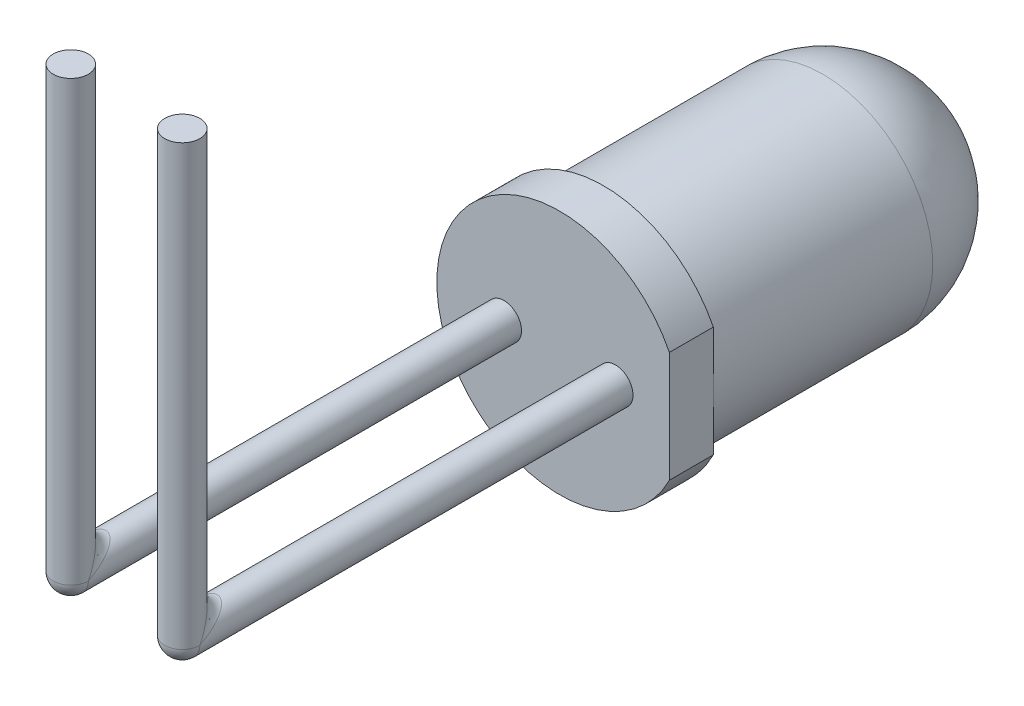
ISO-10303-21;
HEADER;
FILE_DESCRIPTION(('STEP AP214'),'2;1');
FILE_NAME('part.step','',(''),(''),'','','');
FILE_SCHEMA(('AUTOMOTIVE_DESIGN { 1 0 10303 214 1 1 1 1 }'));
ENDSEC;
DATA;
#1=APPLICATION_CONTEXT('core data for automotive mechanical design processes');
#2=APPLICATION_PROTOCOL_DEFINITION('international standard','automotive_design',2000,#1);
#3=PRODUCT_CONTEXT('',#1,'mechanical');
#4=PRODUCT('Part','Part','',(#3));
#5=PRODUCT_RELATED_PRODUCT_CATEGORY('part','',(#4));
#6=PRODUCT_DEFINITION_FORMATION('','',#4);
#7=PRODUCT_DEFINITION_CONTEXT('part definition',#1,'design');
#8=PRODUCT_DEFINITION('design','',#6,#7);
#9=PRODUCT_DEFINITION_SHAPE('','',#8);
#10=(LENGTH_UNIT() NAMED_UNIT(*) SI_UNIT(.MILLI.,.METRE.));
#11=(NAMED_UNIT(*) PLANE_ANGLE_UNIT() SI_UNIT($,.RADIAN.));
#12=(NAMED_UNIT(*) SI_UNIT($,.STERADIAN.) SOLID_ANGLE_UNIT());
#13=UNCERTAINTY_MEASURE_WITH_UNIT(LENGTH_MEASURE(1.E-05),#10,'distance_accuracy_value','');
#14=(GEOMETRIC_REPRESENTATION_CONTEXT(3) GLOBAL_UNCERTAINTY_ASSIGNED_CONTEXT((#13)) GLOBAL_UNIT_ASSIGNED_CONTEXT((#10,
#11,#12)) REPRESENTATION_CONTEXT('',''));
#15=CARTESIAN_POINT('',(0.,0.,0.));
#16=DIRECTION('',(0.,0.,1.));
#17=DIRECTION('',(1.,0.,0.));
#18=AXIS2_PLACEMENT_3D('',#15,#16,#17);
#19=CARTESIAN_POINT('',(0.,0.,8.5));
#20=DIRECTION('',(0.,0.,-1.));
#21=DIRECTION('',(-1.,0.,0.));
#22=AXIS2_PLACEMENT_3D('',#19,#20,#21);
#23=CYLINDRICAL_SURFACE('',#22,2.5);
#24=CARTESIAN_POINT('',(0.,0.,2.5));
#25=DIRECTION('',(0.,0.,-1.));
#26=DIRECTION('',(-1.,0.,0.));
#27=AXIS2_PLACEMENT_3D('',#24,#25,#26);
#28=CIRCLE('',#27,2.5);
#29=CARTESIAN_POINT('',(-2.5,0.,2.5));
#30=VERTEX_POINT('',#29);
#31=EDGE_CURVE('E99',#30,#30,#28,.F.);
#32=ORIENTED_EDGE('',*,*,#31,.T.);
#33=EDGE_LOOP('',(#32));
#34=FACE_BOUND('',#33,.T.);
#35=CARTESIAN_POINT('',(0.,0.,7.5));
#36=DIRECTION('',(0.,0.,1.));
#37=DIRECTION('',(1.,0.,0.));
#38=AXIS2_PLACEMENT_3D('',#35,#36,#37);
#39=CIRCLE('',#38,2.5);
#40=CARTESIAN_POINT('',(2.5,0.,7.5));
#41=VERTEX_POINT('',#40);
#42=EDGE_CURVE('E95',#41,#41,#39,.T.);
#43=ORIENTED_EDGE('',*,*,#42,.F.);
#44=EDGE_LOOP('',(#43));
#45=FACE_BOUND('',#44,.T.);
#46=ADVANCED_FACE('F28',(#34,#45),#23,.T.);
#47=CARTESIAN_POINT('',(0.,0.,7.5));
#48=DIRECTION('',(0.,0.,1.));
#49=DIRECTION('',(1.,0.,0.));
#50=AXIS2_PLACEMENT_3D('',#47,#48,#49);
#51=PLANE('',#50);
#52=DIRECTION('',(0.,1.,0.));
#53=VECTOR('',#52,1.);
#54=CARTESIAN_POINT('',(2.5,1.26095202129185,7.5));
#55=LINE('',#54,#53);
#56=CARTESIAN_POINT('',(2.5,1.26095202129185,7.5));
#57=VERTEX_POINT('',#56);
#58=EDGE_CURVE('E90',#41,#57,#55,.T.);
#59=ORIENTED_EDGE('',*,*,#58,.F.);
#60=ORIENTED_EDGE('',*,*,#42,.T.);
#61=CARTESIAN_POINT('',(2.5,-1.26095202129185,7.5));
#62=VERTEX_POINT('',#61);
#63=EDGE_CURVE('E80',#62,#41,#55,.T.);
#64=ORIENTED_EDGE('',*,*,#63,.F.);
#65=CARTESIAN_POINT('',(0.,0.,7.5));
#66=DIRECTION('',(0.,0.,1.));
#67=DIRECTION('',(1.,0.,0.));
#68=AXIS2_PLACEMENT_3D('',#65,#66,#67);
#69=CIRCLE('',#68,2.8);
#70=EDGE_CURVE('E74',#57,#62,#69,.T.);
#71=ORIENTED_EDGE('',*,*,#70,.F.);
#72=EDGE_LOOP('',(#59,#60,#64,#71));
#73=FACE_BOUND('',#72,.T.);
#74=ADVANCED_FACE('F140',(#73),#51,.F.);
#75=CARTESIAN_POINT('',(2.5,1.26095202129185,7.5));
#76=DIRECTION('',(1.,0.,0.));
#77=DIRECTION('',(0.,0.,-1.));
#78=AXIS2_PLACEMENT_3D('',#75,#76,#77);
#79=PLANE('',#78);
#80=ORIENTED_EDGE('',*,*,#63,.T.);
#81=ORIENTED_EDGE('',*,*,#58,.T.);
#82=DIRECTION('',(0.,0.,1.));
#83=VECTOR('',#82,1.);
#84=CARTESIAN_POINT('',(2.5,1.26095202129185,7.5));
#85=LINE('',#84,#83);
#86=CARTESIAN_POINT('',(2.5,1.26095202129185,8.5));
#87=VERTEX_POINT('',#86);
#88=EDGE_CURVE('E79',#57,#87,#85,.T.);
#89=ORIENTED_EDGE('',*,*,#88,.T.);
#90=DIRECTION('',(0.,1.,0.));
#91=VECTOR('',#90,1.);
#92=CARTESIAN_POINT('',(2.5,1.26095202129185,8.5));
#93=LINE('',#92,#91);
#94=CARTESIAN_POINT('',(2.5,-1.26095202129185,8.5));
#95=VERTEX_POINT('',#94);
#96=EDGE_CURVE('E84',#95,#87,#93,.T.);
#97=ORIENTED_EDGE('',*,*,#96,.F.);
#98=DIRECTION('',(0.,0.,1.));
#99=VECTOR('',#98,1.);
#100=CARTESIAN_POINT('',(2.5,-1.26095202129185,7.5));
#101=LINE('',#100,#99);
#102=EDGE_CURVE('E68',#62,#95,#101,.T.);
#103=ORIENTED_EDGE('',*,*,#102,.F.);
#104=EDGE_LOOP('',(#80,#81,#89,#97,#103));
#105=FACE_BOUND('',#104,.T.);
#106=ADVANCED_FACE('F88',(#105),#79,.T.);
#107=CARTESIAN_POINT('',(0.,0.,7.5));
#108=DIRECTION('',(0.,0.,1.));
#109=DIRECTION('',(1.,0.,0.));
#110=AXIS2_PLACEMENT_3D('',#107,#108,#109);
#111=CYLINDRICAL_SURFACE('',#110,2.8);
#112=CARTESIAN_POINT('',(0.,0.,8.5));
#113=DIRECTION('',(0.,0.,1.));
#114=DIRECTION('',(1.,0.,0.));
#115=AXIS2_PLACEMENT_3D('',#112,#113,#114);
#116=CIRCLE('',#115,2.8);
#117=EDGE_CURVE('E72',#87,#95,#116,.T.);
#118=ORIENTED_EDGE('',*,*,#117,.F.);
#119=ORIENTED_EDGE('',*,*,#88,.F.);
#120=ORIENTED_EDGE('',*,*,#70,.T.);
#121=ORIENTED_EDGE('',*,*,#102,.T.);
#122=EDGE_LOOP('',(#118,#119,#120,#121));
#123=FACE_BOUND('',#122,.T.);
#124=ADVANCED_FACE('F70',(#123),#111,.T.);
#125=CARTESIAN_POINT('',(0.,0.,8.5));
#126=DIRECTION('',(0.,0.,1.));
#127=DIRECTION('',(1.,0.,0.));
#128=AXIS2_PLACEMENT_3D('',#125,#126,#127);
#129=PLANE('',#128);
#130=CARTESIAN_POINT('',(-1.27,0.,8.5));
#131=DIRECTION('',(0.,0.,1.));
#132=DIRECTION('',(1.,0.,0.));
#133=AXIS2_PLACEMENT_3D('',#130,#131,#132);
#134=CIRCLE('',#133,0.4);
#135=CARTESIAN_POINT('',(-0.87,0.,8.5));
#136=VERTEX_POINT('',#135);
#137=EDGE_CURVE('E107',#136,#136,#134,.T.);
#138=ORIENTED_EDGE('',*,*,#137,.F.);
#139=EDGE_LOOP('',(#138));
#140=FACE_BOUND('',#139,.T.);
#141=CARTESIAN_POINT('',(1.27,0.,8.5));
#142=DIRECTION('',(0.,0.,1.));
#143=DIRECTION('',(1.,0.,0.));
#144=AXIS2_PLACEMENT_3D('',#141,#142,#143);
#145=CIRCLE('',#144,0.4);
#146=CARTESIAN_POINT('',(1.67,0.,8.5));
#147=VERTEX_POINT('',#146);
#148=EDGE_CURVE('E102',#147,#147,#145,.T.);
#149=ORIENTED_EDGE('',*,*,#148,.F.);
#150=EDGE_LOOP('',(#149));
#151=FACE_BOUND('',#150,.T.);
#152=ORIENTED_EDGE('',*,*,#96,.T.);
#153=ORIENTED_EDGE('',*,*,#117,.T.);
#154=EDGE_LOOP('',(#152,#153));
#155=FACE_BOUND('',#154,.T.);
#156=ADVANCED_FACE('F83',(#140,#151,#155),#129,.T.);
#157=CARTESIAN_POINT('',(0.,0.,2.5));
#158=DIRECTION('',(0.,0.,1.));
#159=DIRECTION('',(1.,0.,0.));
#160=AXIS2_PLACEMENT_3D('',#157,#158,#159);
#161=SPHERICAL_SURFACE('',#160,2.5);
#162=ORIENTED_EDGE('',*,*,#31,.F.);
#163=EDGE_LOOP('',(#162));
#164=FACE_BOUND('',#163,.T.);
#165=ADVANCED_FACE('F153',(#164),#161,.T.);
#166=CARTESIAN_POINT('',(1.27,0.,18.37));
#167=DIRECTION('',(0.,1.,0.));
#168=DIRECTION('',(0.,0.,1.));
#169=AXIS2_PLACEMENT_3D('',#166,#167,#168);
#170=CYLINDRICAL_SURFACE('',#169,0.4);
#171=CARTESIAN_POINT('',(1.27,0.,18.37));
#172=DIRECTION('',(0.,-0.447213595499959,-0.894427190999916));
#173=DIRECTION('',(0.,0.894427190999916,-0.447213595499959));
#174=AXIS2_PLACEMENT_3D('',#171,#172,#173);
#175=ELLIPSE('',#174,0.894427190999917,0.4);
#176=CARTESIAN_POINT('',(1.67,0.,18.37));
#177=VERTEX_POINT('',#176);
#178=CARTESIAN_POINT('',(0.87,0.,18.37));
#179=VERTEX_POINT('',#178);
#180=EDGE_CURVE('E103',#177,#179,#175,.F.);
#181=ORIENTED_EDGE('',*,*,#180,.T.);
#182=CARTESIAN_POINT('',(1.27,0.,18.37));
#183=DIRECTION('',(0.,1.,0.));
#184=DIRECTION('',(0.,0.,1.));
#185=AXIS2_PLACEMENT_3D('',#182,#183,#184);
#186=CIRCLE('',#185,0.4);
#187=EDGE_CURVE('E106',#179,#177,#186,.T.);
#188=ORIENTED_EDGE('',*,*,#187,.T.);
#189=EDGE_LOOP('',(#181,#188));
#190=FACE_BOUND('',#189,.T.);
#191=CARTESIAN_POINT('',(1.27,10.,18.37));
#192=DIRECTION('',(0.,1.,0.));
#193=DIRECTION('',(0.,0.,1.));
#194=AXIS2_PLACEMENT_3D('',#191,#192,#193);
#195=CIRCLE('',#194,0.4);
#196=CARTESIAN_POINT('',(1.27,10.,18.77));
#197=VERTEX_POINT('',#196);
#198=EDGE_CURVE('E86',#197,#197,#195,.F.);
#199=ORIENTED_EDGE('',*,*,#198,.T.);
#200=EDGE_LOOP('',(#199));
#201=FACE_BOUND('',#200,.T.);
#202=ADVANCED_FACE('F154',(#190,#201),#170,.T.);
#203=CARTESIAN_POINT('',(1.27,0.,19.5013708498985));
#204=DIRECTION('',(0.,0.,-1.));
#205=DIRECTION('',(0.,1.,0.));
#206=AXIS2_PLACEMENT_3D('',#203,#204,#205);
#207=CYLINDRICAL_SURFACE('',#206,0.4);
#208=ORIENTED_EDGE('',*,*,#148,.T.);
#209=EDGE_LOOP('',(#208));
#210=FACE_BOUND('',#209,.T.);
#211=CARTESIAN_POINT('',(1.27,0.,18.37));
#212=DIRECTION('',(0.,0.,-1.));
#213=DIRECTION('',(0.,1.,0.));
#214=AXIS2_PLACEMENT_3D('',#211,#212,#213);
#215=CIRCLE('',#214,0.4);
#216=EDGE_CURVE('E110',#177,#179,#215,.T.);
#217=ORIENTED_EDGE('',*,*,#216,.T.);
#218=CARTESIAN_POINT('',(1.27,0.,18.37));
#219=DIRECTION('',(0.,-0.894427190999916,-0.447213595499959));
#220=DIRECTION('',(0.,0.447213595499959,-0.894427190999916));
#221=AXIS2_PLACEMENT_3D('',#218,#219,#220);
#222=ELLIPSE('',#221,0.894427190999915,0.4);
#223=EDGE_CURVE('E113',#179,#177,#222,.T.);
#224=ORIENTED_EDGE('',*,*,#223,.T.);
#225=EDGE_LOOP('',(#217,#224));
#226=FACE_BOUND('',#225,.T.);
#227=ADVANCED_FACE('F160',(#210,#226),#207,.T.);
#228=CARTESIAN_POINT('',(1.27,10.,18.37));
#229=DIRECTION('',(0.,1.,0.));
#230=DIRECTION('',(0.,0.,1.));
#231=AXIS2_PLACEMENT_3D('',#228,#229,#230);
#232=PLANE('',#231);
#233=ORIENTED_EDGE('',*,*,#198,.F.);
#234=EDGE_LOOP('',(#233));
#235=FACE_BOUND('',#234,.T.);
#236=ADVANCED_FACE('F203',(#235),#232,.T.);
#237=CARTESIAN_POINT('',(-1.27,0.,18.37));
#238=DIRECTION('',(0.,1.,0.));
#239=DIRECTION('',(0.,0.,1.));
#240=AXIS2_PLACEMENT_3D('',#237,#238,#239);
#241=CYLINDRICAL_SURFACE('',#240,0.4);
#242=CARTESIAN_POINT('',(-1.27,0.,18.37));
#243=DIRECTION('',(0.,-0.447213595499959,-0.894427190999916));
#244=DIRECTION('',(0.,0.894427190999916,-0.447213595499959));
#245=AXIS2_PLACEMENT_3D('',#242,#243,#244);
#246=ELLIPSE('',#245,0.894427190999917,0.4);
#247=CARTESIAN_POINT('',(-0.87,0.,18.37));
#248=VERTEX_POINT('',#247);
#249=CARTESIAN_POINT('',(-1.67,0.,18.37));
#250=VERTEX_POINT('',#249);
#251=EDGE_CURVE('E116',#248,#250,#246,.F.);
#252=ORIENTED_EDGE('',*,*,#251,.T.);
#253=CARTESIAN_POINT('',(-1.27,0.,18.37));
#254=DIRECTION('',(0.,1.,0.));
#255=DIRECTION('',(0.,0.,1.));
#256=AXIS2_PLACEMENT_3D('',#253,#254,#255);
#257=CIRCLE('',#256,0.4);
#258=EDGE_CURVE('E119',#250,#248,#257,.T.);
#259=ORIENTED_EDGE('',*,*,#258,.T.);
#260=EDGE_LOOP('',(#252,#259));
#261=FACE_BOUND('',#260,.T.);
#262=CARTESIAN_POINT('',(-1.27,10.,18.37));
#263=DIRECTION('',(0.,1.,0.));
#264=DIRECTION('',(0.,0.,1.));
#265=AXIS2_PLACEMENT_3D('',#262,#263,#264);
#266=CIRCLE('',#265,0.4);
#267=CARTESIAN_POINT('',(-1.27,10.,18.77));
#268=VERTEX_POINT('',#267);
#269=EDGE_CURVE('E262',#268,#268,#266,.F.);
#270=ORIENTED_EDGE('',*,*,#269,.T.);
#271=EDGE_LOOP('',(#270));
#272=FACE_BOUND('',#271,.T.);
#273=ADVANCED_FACE('F124',(#261,#272),#241,.T.);
#274=CARTESIAN_POINT('',(-1.27,0.,19.5013708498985));
#275=DIRECTION('',(0.,0.,-1.));
#276=DIRECTION('',(0.,1.,0.));
#277=AXIS2_PLACEMENT_3D('',#274,#275,#276);
#278=CYLINDRICAL_SURFACE('',#277,0.4);
#279=ORIENTED_EDGE('',*,*,#137,.T.);
#280=EDGE_LOOP('',(#279));
#281=FACE_BOUND('',#280,.T.);
#282=CARTESIAN_POINT('',(-1.27,0.,18.37));
#283=DIRECTION('',(0.,0.,-1.));
#284=DIRECTION('',(0.,1.,0.));
#285=AXIS2_PLACEMENT_3D('',#282,#283,#284);
#286=CIRCLE('',#285,0.4);
#287=EDGE_CURVE('E35',#248,#250,#286,.T.);
#288=ORIENTED_EDGE('',*,*,#287,.T.);
#289=CARTESIAN_POINT('',(-1.27,0.,18.37));
#290=DIRECTION('',(0.,-0.894427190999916,-0.447213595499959));
#291=DIRECTION('',(0.,0.447213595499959,-0.894427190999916));
#292=AXIS2_PLACEMENT_3D('',#289,#290,#291);
#293=ELLIPSE('',#292,0.894427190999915,0.4);
#294=EDGE_CURVE('E12',#250,#248,#293,.T.);
#295=ORIENTED_EDGE('',*,*,#294,.T.);
#296=EDGE_LOOP('',(#288,#295));
#297=FACE_BOUND('',#296,.T.);
#298=ADVANCED_FACE('F122',(#281,#297),#278,.T.);
#299=CARTESIAN_POINT('',(-1.27,10.,18.37));
#300=DIRECTION('',(0.,1.,0.));
#301=DIRECTION('',(0.,0.,1.));
#302=AXIS2_PLACEMENT_3D('',#299,#300,#301);
#303=PLANE('',#302);
#304=ORIENTED_EDGE('',*,*,#269,.F.);
#305=EDGE_LOOP('',(#304));
#306=FACE_BOUND('',#305,.T.);
#307=ADVANCED_FACE('F222',(#306),#303,.T.);
#308=CARTESIAN_POINT('',(1.27,0.,18.37));
#309=DIRECTION('',(0.,0.,1.));
#310=DIRECTION('',(1.,0.,0.));
#311=AXIS2_PLACEMENT_3D('',#308,#309,#310);
#312=SPHERICAL_SURFACE('',#311,0.4);
#313=ORIENTED_EDGE('',*,*,#187,.F.);
#314=ORIENTED_EDGE('',*,*,#216,.F.);
#315=EDGE_LOOP('',(#313,#314));
#316=FACE_BOUND('',#315,.T.);
#317=ADVANCED_FACE('F136',(#316),#312,.T.);
#318=CARTESIAN_POINT('',(1.67,0.,18.37));
#319=CARTESIAN_POINT('',(1.67,0.,18.37));
#320=CARTESIAN_POINT('',(1.67,0.,18.37));
#321=CARTESIAN_POINT('',(1.66999298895,0.0348517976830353,18.3525741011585));
#322=CARTESIAN_POINT('',(1.67005108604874,0.0261441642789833,18.343855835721));
#323=CARTESIAN_POINT('',(1.66999298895,0.0174258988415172,18.335148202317));
#324=CARTESIAN_POINT('',(1.66886070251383,0.0697124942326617,18.3351437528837));
#325=CARTESIAN_POINT('',(1.66772093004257,0.0523600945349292,18.3176399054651));
#326=CARTESIAN_POINT('',(1.66886070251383,0.0348562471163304,18.3002875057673));
#327=CARTESIAN_POINT('',(1.66431458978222,0.138834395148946,18.3005828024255));
#328=CARTESIAN_POINT('',(1.65863330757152,0.103749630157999,18.266250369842));
#329=CARTESIAN_POINT('',(1.66431458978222,0.0694171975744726,18.231165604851));
#330=CARTESIAN_POINT('',(1.66092023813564,0.173098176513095,18.2834509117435));
#331=CARTESIAN_POINT('',(1.65186272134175,0.129071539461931,18.2409284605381));
#332=CARTESIAN_POINT('',(1.66092023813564,0.0865490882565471,18.1969018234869));
#333=CARTESIAN_POINT('',(1.65189673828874,0.24044273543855,18.2497786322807));
#334=CARTESIAN_POINT('',(1.63414910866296,0.177786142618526,18.1922138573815));
#335=CARTESIAN_POINT('',(1.65189673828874,0.120221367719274,18.1295572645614));
#336=CARTESIAN_POINT('',(1.6463060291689,0.273533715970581,18.2332331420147));
#337=CARTESIAN_POINT('',(1.62318021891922,0.201325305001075,18.1686746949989));
#338=CARTESIAN_POINT('',(1.6463060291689,0.13676685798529,18.0964662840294));
#339=CARTESIAN_POINT('',(1.63296398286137,0.337956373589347,18.2010218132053));
#340=CARTESIAN_POINT('',(1.59763412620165,0.245616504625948,18.124383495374));
#341=CARTESIAN_POINT('',(1.63296398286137,0.168978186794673,18.0320436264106));
#342=CARTESIAN_POINT('',(1.62526926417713,0.369311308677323,18.1853443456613));
#343=CARTESIAN_POINT('',(1.58301825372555,0.266510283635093,18.1034897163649));
#344=CARTESIAN_POINT('',(1.62526926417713,0.184655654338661,18.0006886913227));
#345=CARTESIAN_POINT('',(1.60783304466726,0.429711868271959,18.155144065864));
#346=CARTESIAN_POINT('',(1.55100028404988,0.304712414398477,18.0652875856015));
#347=CARTESIAN_POINT('',(1.60783304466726,0.214855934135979,17.940288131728));
#348=CARTESIAN_POINT('',(1.59816448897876,0.458799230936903,18.1406003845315));
#349=CARTESIAN_POINT('',(1.53354818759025,0.32215419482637,18.0478458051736));
#350=CARTESIAN_POINT('',(1.59816448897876,0.229399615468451,17.9112007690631));
#351=CARTESIAN_POINT('',(1.57692939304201,0.514147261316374,18.1129263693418));
#352=CARTESIAN_POINT('',(1.49701863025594,0.352779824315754,18.0172201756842));
#353=CARTESIAN_POINT('',(1.57692939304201,0.257073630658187,17.8558527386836));
#354=CARTESIAN_POINT('',(1.56544892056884,0.540473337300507,18.0997633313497));
#355=CARTESIAN_POINT('',(1.47788315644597,0.366083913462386,18.0039160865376));
#356=CARTESIAN_POINT('',(1.56544892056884,0.270236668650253,17.8295266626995));
#357=CARTESIAN_POINT('',(1.54077355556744,0.589823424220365,18.0750882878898));
#358=CARTESIAN_POINT('',(1.43951787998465,0.388004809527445,17.9819951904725));
#359=CARTESIAN_POINT('',(1.54077355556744,0.294911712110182,17.7801765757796));
#360=CARTESIAN_POINT('',(1.52767253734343,0.612940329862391,18.0635298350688));
#361=CARTESIAN_POINT('',(1.42022816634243,0.396723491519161,17.9732765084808));
#362=CARTESIAN_POINT('',(1.52767253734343,0.306470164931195,17.7570596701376));
#363=CARTESIAN_POINT('',(1.49997342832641,0.655447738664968,18.0422761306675));
#364=CARTESIAN_POINT('',(1.38341468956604,0.409472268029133,17.9605277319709));
#365=CARTESIAN_POINT('',(1.49997342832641,0.327723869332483,17.714552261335));
#366=CARTESIAN_POINT('',(1.48546909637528,0.674959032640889,18.0325204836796));
#367=CARTESIAN_POINT('',(1.36583761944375,0.413582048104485,17.9564179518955));
#368=CARTESIAN_POINT('',(1.48546909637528,0.337479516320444,17.6950409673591));
#369=CARTESIAN_POINT('',(1.45521408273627,0.709892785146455,18.0150536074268));
#370=CARTESIAN_POINT('',(1.33439698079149,0.417771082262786,17.9522289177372));
#371=CARTESIAN_POINT('',(1.45521408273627,0.354946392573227,17.6601072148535));
#372=CARTESIAN_POINT('',(1.43954673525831,0.725457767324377,18.0072711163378));
#373=CARTESIAN_POINT('',(1.32049509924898,0.417907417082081,17.9520925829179));
#374=CARTESIAN_POINT('',(1.43954673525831,0.362728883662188,17.6445422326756));
#375=CARTESIAN_POINT('',(1.40724861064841,0.752212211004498,17.9938938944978));
#376=CARTESIAN_POINT('',(1.2978686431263,0.41562409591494,17.9543759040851));
#377=CARTESIAN_POINT('',(1.40724861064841,0.376106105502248,17.6177877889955));
#378=CARTESIAN_POINT('',(1.39068005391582,0.763549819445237,17.9882250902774));
#379=CARTESIAN_POINT('',(1.28912434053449,0.413242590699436,17.9567574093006));
#380=CARTESIAN_POINT('',(1.39068005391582,0.381774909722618,17.6064501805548));
#381=CARTESIAN_POINT('',(1.35689020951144,0.781655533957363,17.9791722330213));
#382=CARTESIAN_POINT('',(1.2769352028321,0.40803809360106,17.9619619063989));
#383=CARTESIAN_POINT('',(1.35689020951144,0.390827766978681,17.5883444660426));
#384=CARTESIAN_POINT('',(1.33970345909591,0.788550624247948,17.975724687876));
#385=CARTESIAN_POINT('',(1.27348474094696,0.405239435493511,17.9647605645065));
#386=CARTESIAN_POINT('',(1.33970345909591,0.394275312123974,17.581449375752));
#387=CARTESIAN_POINT('',(1.30500449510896,0.797685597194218,17.9711572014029));
#388=CARTESIAN_POINT('',(1.27002308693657,0.401214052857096,17.9687859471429));
#389=CARTESIAN_POINT('',(1.30500449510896,0.398842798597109,17.5723144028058));
#390=CARTESIAN_POINT('',(1.28750224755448,0.799999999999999,17.97));
#391=CARTESIAN_POINT('',(1.27001157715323,0.399999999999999,17.97));
#392=CARTESIAN_POINT('',(1.28750224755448,0.399999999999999,17.57));
#393=CARTESIAN_POINT('',(1.25249775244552,0.799999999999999,17.97));
#394=CARTESIAN_POINT('',(1.26998842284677,0.399999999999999,17.97));
#395=CARTESIAN_POINT('',(1.25249775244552,0.399999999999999,17.57));
#396=CARTESIAN_POINT('',(1.23499550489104,0.797685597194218,17.9711572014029));
#397=CARTESIAN_POINT('',(1.26997691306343,0.401214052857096,17.9687859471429));
#398=CARTESIAN_POINT('',(1.23499550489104,0.398842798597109,17.5723144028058));
#399=CARTESIAN_POINT('',(1.20029654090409,0.788550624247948,17.975724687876));
#400=CARTESIAN_POINT('',(1.26651525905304,0.405239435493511,17.9647605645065));
#401=CARTESIAN_POINT('',(1.20029654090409,0.394275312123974,17.581449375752));
#402=CARTESIAN_POINT('',(1.18310979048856,0.781655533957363,17.9791722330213));
#403=CARTESIAN_POINT('',(1.2630647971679,0.40803809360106,17.9619619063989));
#404=CARTESIAN_POINT('',(1.18310979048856,0.390827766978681,17.5883444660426));
#405=CARTESIAN_POINT('',(1.14931994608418,0.763549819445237,17.9882250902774));
#406=CARTESIAN_POINT('',(1.25087565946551,0.413242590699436,17.9567574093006));
#407=CARTESIAN_POINT('',(1.14931994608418,0.381774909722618,17.6064501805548));
#408=CARTESIAN_POINT('',(1.13275138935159,0.752212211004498,17.9938938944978));
#409=CARTESIAN_POINT('',(1.2421313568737,0.41562409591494,17.9543759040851));
#410=CARTESIAN_POINT('',(1.13275138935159,0.376106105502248,17.6177877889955));
#411=CARTESIAN_POINT('',(1.10045326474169,0.725457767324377,18.0072711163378));
#412=CARTESIAN_POINT('',(1.21950490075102,0.417907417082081,17.9520925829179));
#413=CARTESIAN_POINT('',(1.10045326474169,0.362728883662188,17.6445422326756));
#414=CARTESIAN_POINT('',(1.08478591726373,0.709892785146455,18.0150536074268));
#415=CARTESIAN_POINT('',(1.20560301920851,0.417771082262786,17.9522289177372));
#416=CARTESIAN_POINT('',(1.08478591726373,0.354946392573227,17.6601072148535));
#417=CARTESIAN_POINT('',(1.05453090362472,0.674959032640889,18.0325204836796));
#418=CARTESIAN_POINT('',(1.17416238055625,0.413582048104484,17.9564179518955));
#419=CARTESIAN_POINT('',(1.05453090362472,0.337479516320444,17.6950409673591));
#420=CARTESIAN_POINT('',(1.04002657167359,0.655447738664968,18.0422761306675));
#421=CARTESIAN_POINT('',(1.15658531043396,0.409472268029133,17.9605277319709));
#422=CARTESIAN_POINT('',(1.04002657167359,0.327723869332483,17.714552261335));
#423=CARTESIAN_POINT('',(1.01232746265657,0.612940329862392,18.0635298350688));
#424=CARTESIAN_POINT('',(1.11977183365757,0.396723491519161,17.9732765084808));
#425=CARTESIAN_POINT('',(1.01232746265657,0.306470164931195,17.7570596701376));
#426=CARTESIAN_POINT('',(0.999226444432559,0.589823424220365,18.0750882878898));
#427=CARTESIAN_POINT('',(1.10048212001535,0.388004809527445,17.9819951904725));
#428=CARTESIAN_POINT('',(0.999226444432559,0.294911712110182,17.7801765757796));
#429=CARTESIAN_POINT('',(0.974551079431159,0.540473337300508,18.0997633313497));
#430=CARTESIAN_POINT('',(1.06211684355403,0.366083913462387,18.0039160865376));
#431=CARTESIAN_POINT('',(0.974551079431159,0.270236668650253,17.8295266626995));
#432=CARTESIAN_POINT('',(0.96307060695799,0.514147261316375,18.1129263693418));
#433=CARTESIAN_POINT('',(1.04298136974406,0.352779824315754,18.0172201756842));
#434=CARTESIAN_POINT('',(0.963070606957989,0.257073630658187,17.8558527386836));
#435=CARTESIAN_POINT('',(0.941835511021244,0.458799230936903,18.1406003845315));
#436=CARTESIAN_POINT('',(1.00645181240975,0.32215419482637,18.0478458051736));
#437=CARTESIAN_POINT('',(0.941835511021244,0.229399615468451,17.9112007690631));
#438=CARTESIAN_POINT('',(0.932166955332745,0.429711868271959,18.155144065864));
#439=CARTESIAN_POINT('',(0.988999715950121,0.304712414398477,18.0652875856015));
#440=CARTESIAN_POINT('',(0.932166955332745,0.214855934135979,17.940288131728));
#441=CARTESIAN_POINT('',(0.91473073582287,0.369311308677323,18.1853443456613));
#442=CARTESIAN_POINT('',(0.956981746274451,0.266510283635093,18.1034897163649));
#443=CARTESIAN_POINT('',(0.91473073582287,0.184655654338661,18.0006886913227));
#444=CARTESIAN_POINT('',(0.907036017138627,0.337956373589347,18.2010218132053));
#445=CARTESIAN_POINT('',(0.942365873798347,0.245616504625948,18.124383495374));
#446=CARTESIAN_POINT('',(0.907036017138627,0.168978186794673,18.0320436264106));
#447=CARTESIAN_POINT('',(0.893693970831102,0.273533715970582,18.2332331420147));
#448=CARTESIAN_POINT('',(0.916819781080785,0.201325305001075,18.1686746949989));
#449=CARTESIAN_POINT('',(0.893693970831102,0.13676685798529,18.0964662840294));
#450=CARTESIAN_POINT('',(0.888103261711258,0.24044273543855,18.2497786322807));
#451=CARTESIAN_POINT('',(0.905850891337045,0.177786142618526,18.1922138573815));
#452=CARTESIAN_POINT('',(0.888103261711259,0.120221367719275,18.1295572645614));
#453=CARTESIAN_POINT('',(0.879079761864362,0.173098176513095,18.2834509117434));
#454=CARTESIAN_POINT('',(0.888137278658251,0.129071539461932,18.2409284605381));
#455=CARTESIAN_POINT('',(0.879079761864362,0.0865490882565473,18.1969018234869));
#456=CARTESIAN_POINT('',(0.87568541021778,0.138834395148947,18.3005828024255));
#457=CARTESIAN_POINT('',(0.881366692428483,0.103749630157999,18.266250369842));
#458=CARTESIAN_POINT('',(0.87568541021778,0.0694171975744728,18.231165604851));
#459=CARTESIAN_POINT('',(0.871139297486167,0.069712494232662,18.3351437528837));
#460=CARTESIAN_POINT('',(0.872279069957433,0.0523600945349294,18.3176399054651));
#461=CARTESIAN_POINT('',(0.871139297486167,0.0348562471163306,18.3002875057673));
#462=CARTESIAN_POINT('',(0.870007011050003,0.0348517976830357,18.3525741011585));
#463=CARTESIAN_POINT('',(0.869948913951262,0.0261441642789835,18.343855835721));
#464=CARTESIAN_POINT('',(0.870007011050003,0.0174258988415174,18.335148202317));
#465=CARTESIAN_POINT('',(0.87,0.,18.37));
#466=CARTESIAN_POINT('',(0.87,0.,18.37));
#467=CARTESIAN_POINT('',(0.87,0.,18.37));
#468=(BOUNDED_SURFACE() B_SPLINE_SURFACE(3,2,((#318,#319,#320),(#321,#322,#323),(#324,#325,
#326),(#327,#328,#329),(#330,#331,#332),(#333,#334,#335),(#336,#337,#338),(#339,#340,#341),
(#342,#343,#344),(#345,#346,#347),(#348,#349,#350),(#351,#352,#353),(#354,#355,#356),(#357,#358,
#359),(#360,#361,#362),(#363,#364,#365),(#366,#367,#368),(#369,#370,#371),(#372,#373,#374),
(#375,#376,#377),(#378,#379,#380),(#381,#382,#383),(#384,#385,#386),(#387,#388,#389),(#390,#391,
#392),(#393,#394,#395),(#396,#397,#398),(#399,#400,#401),(#402,#403,#404),(#405,#406,#407),
(#408,#409,#410),(#411,#412,#413),(#414,#415,#416),(#417,#418,#419),(#420,#421,#422),(#423,#424,
#425),(#426,#427,#428),(#429,#430,#431),(#432,#433,#434),(#435,#436,#437),(#438,#439,#440),
(#441,#442,#443),(#444,#445,#446),(#447,#448,#449),(#450,#451,#452),(#453,#454,#455),(#456,#457,
#458),(#459,#460,#461),(#462,#463,#464),(#465,#466,#467)),.UNSPECIFIED.,.F.,.F.,
.F.) B_SPLINE_SURFACE_WITH_KNOTS((4,2,2,2,2,2,2,2,2,2,2,2,2,2,2,2,2,2,2,2,2,2,2,2,4),(3,3),(0.,
0.147832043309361,0.294407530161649,0.438524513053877,0.579091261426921,0.715183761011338,
0.846105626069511,0.971449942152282,1.09116027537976,1.2055837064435,1.31550198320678,
1.42211980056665,1.52698838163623,1.63185696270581,1.73847478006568,1.84839305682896,
1.9628164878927,2.08252682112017,2.20787113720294,2.33879300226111,2.47488550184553,
2.61545225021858,2.7595692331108,2.90614471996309,3.05397676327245),(0.,1.),
.UNSPECIFIED.) GEOMETRIC_REPRESENTATION_ITEM() RATIONAL_B_SPLINE_SURFACE(((1.,1.,1.),(1.,
1.00000566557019,1.),(1.,0.998576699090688,1.),(1.,0.992910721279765,1.),(1.,0.988697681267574,
1.),(1.,0.977617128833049,1.),(1.,0.970795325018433,1.),(1.,0.954789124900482,1.),(1.,
0.94566706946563,1.),(1.,0.925487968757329,1.),(1.,0.914501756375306,1.),(1.,0.891169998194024,
1.),(1.,0.878891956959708,1.),(1.,0.853706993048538,1.),(1.,0.84084914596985,1.),(1.,
0.815387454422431,1.),(1.,0.802798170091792,1.),(1.,0.778880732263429,1.),(1.,0.767521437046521,
1.),(1.,0.747118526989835,1.),(1.,0.738001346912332,1.),(1.,0.723039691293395,1.),(1.,
0.717105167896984,1.),(1.,0.709170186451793,1.),(1.,0.707106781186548,1.),(1.,0.707106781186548,
1.),(1.,0.709170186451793,1.),(1.,0.717105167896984,1.),(1.,0.723039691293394,1.),(1.,
0.738001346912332,1.),(1.,0.747118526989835,1.),(1.,0.767521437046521,1.),(1.,0.778880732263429,
1.),(1.,0.802798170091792,1.),(1.,0.815387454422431,1.),(1.,0.84084914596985,1.),(1.,
0.853706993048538,1.),(1.,0.878891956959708,1.),(1.,0.891169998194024,1.),(1.,0.914501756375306,
1.),(1.,0.925487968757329,1.),(1.,0.94566706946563,1.),(1.,0.954789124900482,1.),(1.,
0.970795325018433,1.),(1.,0.97761712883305,1.),(1.,0.988697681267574,1.),(1.,0.992910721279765,
1.),(1.,0.998576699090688,1.),(1.,1.00000566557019,1.),(1.,1.,1.))) REPRESENTATION_ITEM('') SURFACE());
#469=ORIENTED_EDGE('',*,*,#180,.F.);
#470=ORIENTED_EDGE('',*,*,#223,.F.);
#471=EDGE_LOOP('',(#469,#470));
#472=FACE_BOUND('',#471,.T.);
#473=ADVANCED_FACE('F129',(#472),#468,.F.);
#474=CARTESIAN_POINT('',(-1.27,0.,18.37));
#475=DIRECTION('',(0.,0.,1.));
#476=DIRECTION('',(1.,0.,0.));
#477=AXIS2_PLACEMENT_3D('',#474,#475,#476);
#478=SPHERICAL_SURFACE('',#477,0.4);
#479=ORIENTED_EDGE('',*,*,#258,.F.);
#480=ORIENTED_EDGE('',*,*,#287,.F.);
#481=EDGE_LOOP('',(#479,#480));
#482=FACE_BOUND('',#481,.T.);
#483=ADVANCED_FACE('F126',(#482),#478,.T.);
#484=CARTESIAN_POINT('',(-0.87,0.,18.37));
#485=CARTESIAN_POINT('',(-0.87,0.,18.37));
#486=CARTESIAN_POINT('',(-0.87,0.,18.37));
#487=CARTESIAN_POINT('',(-0.870007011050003,0.0348517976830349,18.3525741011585));
#488=CARTESIAN_POINT('',(-0.869948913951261,0.026144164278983,18.343855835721));
#489=CARTESIAN_POINT('',(-0.870007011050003,0.0174258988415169,18.335148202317));
#490=CARTESIAN_POINT('',(-0.871139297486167,0.0697124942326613,18.3351437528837));
#491=CARTESIAN_POINT('',(-0.872279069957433,0.0523600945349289,18.3176399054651));
#492=CARTESIAN_POINT('',(-0.871139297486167,0.0348562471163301,18.3002875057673));
#493=CARTESIAN_POINT('',(-0.87568541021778,0.138834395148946,18.3005828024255));
#494=CARTESIAN_POINT('',(-0.881366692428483,0.103749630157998,18.266250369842));
#495=CARTESIAN_POINT('',(-0.875685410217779,0.0694171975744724,18.231165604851));
#496=CARTESIAN_POINT('',(-0.879079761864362,0.173098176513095,18.2834509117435));
#497=CARTESIAN_POINT('',(-0.88813727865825,0.129071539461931,18.2409284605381));
#498=CARTESIAN_POINT('',(-0.879079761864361,0.0865490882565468,18.1969018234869));
#499=CARTESIAN_POINT('',(-0.888103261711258,0.240442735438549,18.2497786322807));
#500=CARTESIAN_POINT('',(-0.905850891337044,0.177786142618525,18.1922138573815));
#501=CARTESIAN_POINT('',(-0.888103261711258,0.120221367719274,18.1295572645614));
#502=CARTESIAN_POINT('',(-0.893693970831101,0.273533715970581,18.2332331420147));
#503=CARTESIAN_POINT('',(-0.916819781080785,0.201325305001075,18.1686746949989));
#504=CARTESIAN_POINT('',(-0.893693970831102,0.13676685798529,18.0964662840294));
#505=CARTESIAN_POINT('',(-0.907036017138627,0.337956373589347,18.2010218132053));
#506=CARTESIAN_POINT('',(-0.942365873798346,0.245616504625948,18.124383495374));
#507=CARTESIAN_POINT('',(-0.907036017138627,0.168978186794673,18.0320436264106));
#508=CARTESIAN_POINT('',(-0.914730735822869,0.369311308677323,18.1853443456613));
#509=CARTESIAN_POINT('',(-0.956981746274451,0.266510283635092,18.1034897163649));
#510=CARTESIAN_POINT('',(-0.914730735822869,0.184655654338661,18.0006886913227));
#511=CARTESIAN_POINT('',(-0.932166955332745,0.429711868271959,18.155144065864));
#512=CARTESIAN_POINT('',(-0.98899971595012,0.304712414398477,18.0652875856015));
#513=CARTESIAN_POINT('',(-0.932166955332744,0.214855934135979,17.940288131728));
#514=CARTESIAN_POINT('',(-0.941835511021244,0.458799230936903,18.1406003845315));
#515=CARTESIAN_POINT('',(-1.00645181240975,0.322154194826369,18.0478458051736));
#516=CARTESIAN_POINT('',(-0.941835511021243,0.229399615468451,17.9112007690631));
#517=CARTESIAN_POINT('',(-0.963070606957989,0.514147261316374,18.1129263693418));
#518=CARTESIAN_POINT('',(-1.04298136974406,0.352779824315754,18.0172201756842));
#519=CARTESIAN_POINT('',(-0.963070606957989,0.257073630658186,17.8558527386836));
#520=CARTESIAN_POINT('',(-0.974551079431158,0.540473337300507,18.0997633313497));
#521=CARTESIAN_POINT('',(-1.06211684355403,0.366083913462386,18.0039160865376));
#522=CARTESIAN_POINT('',(-0.974551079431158,0.270236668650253,17.8295266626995));
#523=CARTESIAN_POINT('',(-0.999226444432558,0.589823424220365,18.0750882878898));
#524=CARTESIAN_POINT('',(-1.10048212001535,0.388004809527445,17.9819951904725));
#525=CARTESIAN_POINT('',(-0.999226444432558,0.294911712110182,17.7801765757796));
#526=CARTESIAN_POINT('',(-1.01232746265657,0.612940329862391,18.0635298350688));
#527=CARTESIAN_POINT('',(-1.11977183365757,0.396723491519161,17.9732765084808));
#528=CARTESIAN_POINT('',(-1.01232746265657,0.306470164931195,17.7570596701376));
#529=CARTESIAN_POINT('',(-1.04002657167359,0.655447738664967,18.0422761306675));
#530=CARTESIAN_POINT('',(-1.15658531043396,0.409472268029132,17.9605277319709));
#531=CARTESIAN_POINT('',(-1.04002657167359,0.327723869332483,17.714552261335));
#532=CARTESIAN_POINT('',(-1.05453090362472,0.674959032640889,18.0325204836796));
#533=CARTESIAN_POINT('',(-1.17416238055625,0.413582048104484,17.9564179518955));
#534=CARTESIAN_POINT('',(-1.05453090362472,0.337479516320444,17.6950409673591));
#535=CARTESIAN_POINT('',(-1.08478591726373,0.709892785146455,18.0150536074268));
#536=CARTESIAN_POINT('',(-1.20560301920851,0.417771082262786,17.9522289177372));
#537=CARTESIAN_POINT('',(-1.08478591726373,0.354946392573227,17.6601072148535));
#538=CARTESIAN_POINT('',(-1.10045326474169,0.725457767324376,18.0072711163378));
#539=CARTESIAN_POINT('',(-1.21950490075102,0.417907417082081,17.9520925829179));
#540=CARTESIAN_POINT('',(-1.10045326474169,0.362728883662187,17.6445422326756));
#541=CARTESIAN_POINT('',(-1.13275138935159,0.752212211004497,17.9938938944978));
#542=CARTESIAN_POINT('',(-1.2421313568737,0.415624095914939,17.9543759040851));
#543=CARTESIAN_POINT('',(-1.13275138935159,0.376106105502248,17.6177877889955));
#544=CARTESIAN_POINT('',(-1.14931994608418,0.763549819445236,17.9882250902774));
#545=CARTESIAN_POINT('',(-1.25087565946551,0.413242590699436,17.9567574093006));
#546=CARTESIAN_POINT('',(-1.14931994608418,0.381774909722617,17.6064501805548));
#547=CARTESIAN_POINT('',(-1.18310979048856,0.781655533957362,17.9791722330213));
#548=CARTESIAN_POINT('',(-1.2630647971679,0.408038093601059,17.9619619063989));
#549=CARTESIAN_POINT('',(-1.18310979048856,0.39082776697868,17.5883444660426));
#550=CARTESIAN_POINT('',(-1.20029654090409,0.788550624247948,17.975724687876));
#551=CARTESIAN_POINT('',(-1.26651525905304,0.405239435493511,17.9647605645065));
#552=CARTESIAN_POINT('',(-1.20029654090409,0.394275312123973,17.581449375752));
#553=CARTESIAN_POINT('',(-1.23499550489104,0.797685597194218,17.9711572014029));
#554=CARTESIAN_POINT('',(-1.26997691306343,0.401214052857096,17.9687859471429));
#555=CARTESIAN_POINT('',(-1.23499550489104,0.398842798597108,17.5723144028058));
#556=CARTESIAN_POINT('',(-1.25249775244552,0.799999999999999,17.97));
#557=CARTESIAN_POINT('',(-1.26998842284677,0.399999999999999,17.97));
#558=CARTESIAN_POINT('',(-1.25249775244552,0.399999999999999,17.57));
#559=CARTESIAN_POINT('',(-1.28750224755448,0.799999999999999,17.97));
#560=CARTESIAN_POINT('',(-1.27001157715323,0.399999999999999,17.97));
#561=CARTESIAN_POINT('',(-1.28750224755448,0.399999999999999,17.57));
#562=CARTESIAN_POINT('',(-1.30500449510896,0.797685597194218,17.9711572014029));
#563=CARTESIAN_POINT('',(-1.27002308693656,0.401214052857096,17.9687859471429));
#564=CARTESIAN_POINT('',(-1.30500449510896,0.398842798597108,17.5723144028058));
#565=CARTESIAN_POINT('',(-1.33970345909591,0.788550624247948,17.975724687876));
#566=CARTESIAN_POINT('',(-1.27348474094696,0.405239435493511,17.9647605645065));
#567=CARTESIAN_POINT('',(-1.33970345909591,0.394275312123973,17.581449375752));
#568=CARTESIAN_POINT('',(-1.35689020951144,0.781655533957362,17.9791722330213));
#569=CARTESIAN_POINT('',(-1.2769352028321,0.408038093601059,17.9619619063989));
#570=CARTESIAN_POINT('',(-1.35689020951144,0.39082776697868,17.5883444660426));
#571=CARTESIAN_POINT('',(-1.39068005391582,0.763549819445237,17.9882250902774));
#572=CARTESIAN_POINT('',(-1.28912434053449,0.413242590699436,17.9567574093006));
#573=CARTESIAN_POINT('',(-1.39068005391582,0.381774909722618,17.6064501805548));
#574=CARTESIAN_POINT('',(-1.40724861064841,0.752212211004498,17.9938938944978));
#575=CARTESIAN_POINT('',(-1.2978686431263,0.415624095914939,17.9543759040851));
#576=CARTESIAN_POINT('',(-1.40724861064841,0.376106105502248,17.6177877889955));
#577=CARTESIAN_POINT('',(-1.43954673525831,0.725457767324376,18.0072711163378));
#578=CARTESIAN_POINT('',(-1.32049509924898,0.417907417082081,17.9520925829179));
#579=CARTESIAN_POINT('',(-1.43954673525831,0.362728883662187,17.6445422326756));
#580=CARTESIAN_POINT('',(-1.45521408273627,0.709892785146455,18.0150536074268));
#581=CARTESIAN_POINT('',(-1.33439698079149,0.417771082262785,17.9522289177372));
#582=CARTESIAN_POINT('',(-1.45521408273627,0.354946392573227,17.6601072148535));
#583=CARTESIAN_POINT('',(-1.48546909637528,0.674959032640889,18.0325204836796));
#584=CARTESIAN_POINT('',(-1.36583761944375,0.413582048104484,17.9564179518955));
#585=CARTESIAN_POINT('',(-1.48546909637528,0.337479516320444,17.6950409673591));
#586=CARTESIAN_POINT('',(-1.49997342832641,0.655447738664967,18.0422761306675));
#587=CARTESIAN_POINT('',(-1.38341468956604,0.409472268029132,17.9605277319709));
#588=CARTESIAN_POINT('',(-1.49997342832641,0.327723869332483,17.714552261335));
#589=CARTESIAN_POINT('',(-1.52767253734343,0.612940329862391,18.0635298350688));
#590=CARTESIAN_POINT('',(-1.42022816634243,0.396723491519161,17.9732765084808));
#591=CARTESIAN_POINT('',(-1.52767253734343,0.306470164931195,17.7570596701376));
#592=CARTESIAN_POINT('',(-1.54077355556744,0.589823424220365,18.0750882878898));
#593=CARTESIAN_POINT('',(-1.43951787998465,0.388004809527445,17.9819951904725));
#594=CARTESIAN_POINT('',(-1.54077355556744,0.294911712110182,17.7801765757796));
#595=CARTESIAN_POINT('',(-1.56544892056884,0.540473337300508,18.0997633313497));
#596=CARTESIAN_POINT('',(-1.47788315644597,0.366083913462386,18.0039160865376));
#597=CARTESIAN_POINT('',(-1.56544892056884,0.270236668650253,17.8295266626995));
#598=CARTESIAN_POINT('',(-1.57692939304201,0.514147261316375,18.1129263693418));
#599=CARTESIAN_POINT('',(-1.49701863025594,0.352779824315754,18.0172201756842));
#600=CARTESIAN_POINT('',(-1.57692939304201,0.257073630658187,17.8558527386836));
#601=CARTESIAN_POINT('',(-1.59816448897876,0.458799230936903,18.1406003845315));
#602=CARTESIAN_POINT('',(-1.53354818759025,0.32215419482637,18.0478458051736));
#603=CARTESIAN_POINT('',(-1.59816448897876,0.229399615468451,17.9112007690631));
#604=CARTESIAN_POINT('',(-1.60783304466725,0.429711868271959,18.155144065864));
#605=CARTESIAN_POINT('',(-1.55100028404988,0.304712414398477,18.0652875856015));
#606=CARTESIAN_POINT('',(-1.60783304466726,0.214855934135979,17.940288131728));
#607=CARTESIAN_POINT('',(-1.62526926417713,0.369311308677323,18.1853443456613));
#608=CARTESIAN_POINT('',(-1.58301825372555,0.266510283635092,18.1034897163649));
#609=CARTESIAN_POINT('',(-1.62526926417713,0.184655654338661,18.0006886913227));
#610=CARTESIAN_POINT('',(-1.63296398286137,0.337956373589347,18.2010218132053));
#611=CARTESIAN_POINT('',(-1.59763412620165,0.245616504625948,18.1243834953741));
#612=CARTESIAN_POINT('',(-1.63296398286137,0.168978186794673,18.0320436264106));
#613=CARTESIAN_POINT('',(-1.6463060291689,0.273533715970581,18.2332331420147));
#614=CARTESIAN_POINT('',(-1.62318021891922,0.201325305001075,18.1686746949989));
#615=CARTESIAN_POINT('',(-1.6463060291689,0.13676685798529,18.0964662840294));
#616=CARTESIAN_POINT('',(-1.65189673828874,0.24044273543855,18.2497786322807));
#617=CARTESIAN_POINT('',(-1.63414910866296,0.177786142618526,18.1922138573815));
#618=CARTESIAN_POINT('',(-1.65189673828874,0.120221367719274,18.1295572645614));
#619=CARTESIAN_POINT('',(-1.66092023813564,0.173098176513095,18.2834509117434));
#620=CARTESIAN_POINT('',(-1.65186272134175,0.129071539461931,18.2409284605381));
#621=CARTESIAN_POINT('',(-1.66092023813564,0.086549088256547,18.1969018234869));
#622=CARTESIAN_POINT('',(-1.66431458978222,0.138834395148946,18.3005828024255));
#623=CARTESIAN_POINT('',(-1.65863330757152,0.103749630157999,18.266250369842));
#624=CARTESIAN_POINT('',(-1.66431458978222,0.0694171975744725,18.231165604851));
#625=CARTESIAN_POINT('',(-1.66886070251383,0.0697124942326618,18.3351437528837));
#626=CARTESIAN_POINT('',(-1.66772093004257,0.0523600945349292,18.3176399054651));
#627=CARTESIAN_POINT('',(-1.66886070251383,0.0348562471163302,18.3002875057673));
#628=CARTESIAN_POINT('',(-1.66999298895,0.0348517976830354,18.3525741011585));
#629=CARTESIAN_POINT('',(-1.67005108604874,0.0261441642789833,18.343855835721));
#630=CARTESIAN_POINT('',(-1.66999298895,0.017425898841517,18.335148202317));
#631=CARTESIAN_POINT('',(-1.67,0.,18.37));
#632=CARTESIAN_POINT('',(-1.67,0.,18.37));
#633=CARTESIAN_POINT('',(-1.67,0.,18.37));
#634=(BOUNDED_SURFACE() B_SPLINE_SURFACE(3,2,((#484,#485,#486),(#487,#488,#489),(#490,#491,
#492),(#493,#494,#495),(#496,#497,#498),(#499,#500,#501),(#502,#503,#504),(#505,#506,#507),
(#508,#509,#510),(#511,#512,#513),(#514,#515,#516),(#517,#518,#519),(#520,#521,#522),(#523,#524,
#525),(#526,#527,#528),(#529,#530,#531),(#532,#533,#534),(#535,#536,#537),(#538,#539,#540),
(#541,#542,#543),(#544,#545,#546),(#547,#548,#549),(#550,#551,#552),(#553,#554,#555),(#556,#557,
#558),(#559,#560,#561),(#562,#563,#564),(#565,#566,#567),(#568,#569,#570),(#571,#572,#573),
(#574,#575,#576),(#577,#578,#579),(#580,#581,#582),(#583,#584,#585),(#586,#587,#588),(#589,#590,
#591),(#592,#593,#594),(#595,#596,#597),(#598,#599,#600),(#601,#602,#603),(#604,#605,#606),
(#607,#608,#609),(#610,#611,#612),(#613,#614,#615),(#616,#617,#618),(#619,#620,#621),(#622,#623,
#624),(#625,#626,#627),(#628,#629,#630),(#631,#632,#633)),.UNSPECIFIED.,.F.,.F.,
.F.) B_SPLINE_SURFACE_WITH_KNOTS((4,2,2,2,2,2,2,2,2,2,2,2,2,2,2,2,2,2,2,2,2,2,2,2,4),(3,3),(0.,
0.147832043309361,0.294407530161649,0.438524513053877,0.579091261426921,0.715183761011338,
0.846105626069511,0.971449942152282,1.09116027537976,1.2055837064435,1.31550198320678,
1.42211980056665,1.52698838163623,1.63185696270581,1.73847478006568,1.84839305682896,
1.9628164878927,2.08252682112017,2.20787113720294,2.33879300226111,2.47488550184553,
2.61545225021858,2.7595692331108,2.90614471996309,3.05397676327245),(0.,1.),
.UNSPECIFIED.) GEOMETRIC_REPRESENTATION_ITEM() RATIONAL_B_SPLINE_SURFACE(((1.,1.,1.),(1.,
1.00000566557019,1.),(1.,0.998576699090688,1.),(1.,0.992910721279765,1.),(1.,0.988697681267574,
1.),(1.,0.977617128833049,1.),(1.,0.970795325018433,1.),(1.,0.954789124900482,1.),(1.,
0.94566706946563,1.),(1.,0.925487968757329,1.),(1.,0.914501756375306,1.),(1.,0.891169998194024,
1.),(1.,0.878891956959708,1.),(1.,0.853706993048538,1.),(1.,0.84084914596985,1.),(1.,
0.815387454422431,1.),(1.,0.802798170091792,1.),(1.,0.778880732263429,1.),(1.,0.767521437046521,
1.),(1.,0.747118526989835,1.),(1.,0.738001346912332,1.),(1.,0.723039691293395,1.),(1.,
0.717105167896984,1.),(1.,0.709170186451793,1.),(1.,0.707106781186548,1.),(1.,0.707106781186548,
1.),(1.,0.709170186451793,1.),(1.,0.717105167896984,1.),(1.,0.723039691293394,1.),(1.,
0.738001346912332,1.),(1.,0.747118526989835,1.),(1.,0.767521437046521,1.),(1.,0.778880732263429,
1.),(1.,0.802798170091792,1.),(1.,0.815387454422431,1.),(1.,0.84084914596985,1.),(1.,
0.853706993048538,1.),(1.,0.878891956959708,1.),(1.,0.891169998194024,1.),(1.,0.914501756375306,
1.),(1.,0.925487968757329,1.),(1.,0.94566706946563,1.),(1.,0.954789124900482,1.),(1.,
0.970795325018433,1.),(1.,0.97761712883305,1.),(1.,0.988697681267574,1.),(1.,0.992910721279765,
1.),(1.,0.998576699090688,1.),(1.,1.00000566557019,1.),(1.,1.,1.))) REPRESENTATION_ITEM('') SURFACE());
#635=ORIENTED_EDGE('',*,*,#251,.F.);
#636=ORIENTED_EDGE('',*,*,#294,.F.);
#637=EDGE_LOOP('',(#635,#636));
#638=FACE_BOUND('',#637,.T.);
#639=ADVANCED_FACE('F128',(#638),#634,.F.);
#640=CLOSED_SHELL('',(#46,#74,#106,#124,#156,#165,#202,#227,#236,#273,#298,#307,#317,#473,#483,#639));
#641=MANIFOLD_SOLID_BREP('B2',#640);
#642=ADVANCED_BREP_SHAPE_REPRESENTATION('',(#18,#641),#14);
#643=SHAPE_DEFINITION_REPRESENTATION(#9,#642);
ENDSEC;
END-ISO-10303-21;
